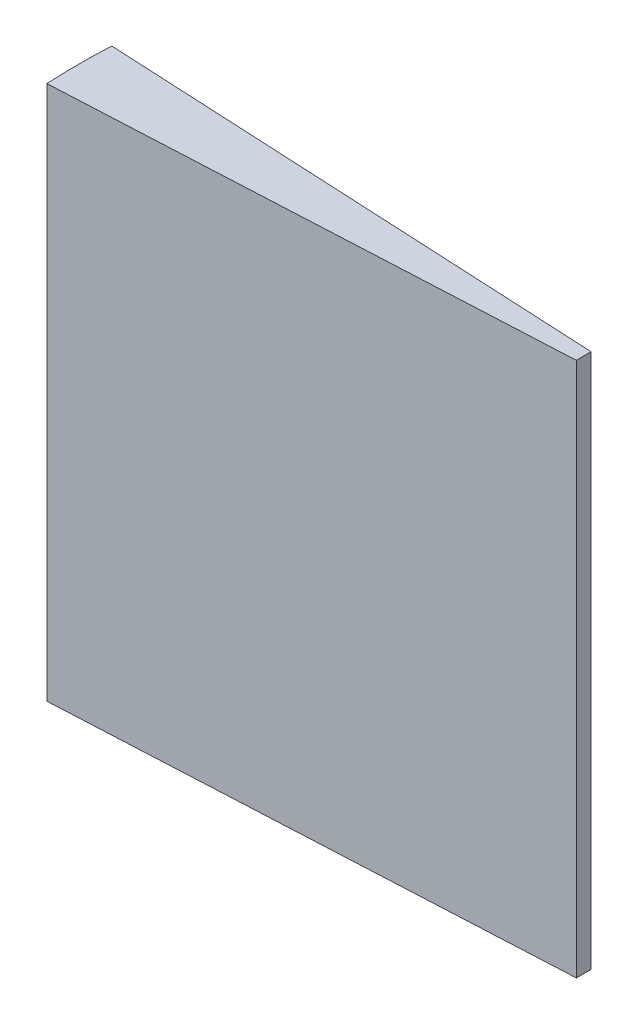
ISO-10303-21;
HEADER;
FILE_DESCRIPTION(('STEP AP214'),'2;1');
FILE_NAME('part.step','',(''),(''),'','','');
FILE_SCHEMA(('AUTOMOTIVE_DESIGN { 1 0 10303 214 1 1 1 1 }'));
ENDSEC;
DATA;
#1=APPLICATION_CONTEXT('core data for automotive mechanical design processes');
#2=APPLICATION_PROTOCOL_DEFINITION('international standard','automotive_design',2000,#1);
#3=PRODUCT_CONTEXT('',#1,'mechanical');
#4=PRODUCT('Part','Part','',(#3));
#5=PRODUCT_RELATED_PRODUCT_CATEGORY('part','',(#4));
#6=PRODUCT_DEFINITION_FORMATION('','',#4);
#7=PRODUCT_DEFINITION_CONTEXT('part definition',#1,'design');
#8=PRODUCT_DEFINITION('design','',#6,#7);
#9=PRODUCT_DEFINITION_SHAPE('','',#8);
#10=(LENGTH_UNIT() NAMED_UNIT(*) SI_UNIT(.MILLI.,.METRE.));
#11=(NAMED_UNIT(*) PLANE_ANGLE_UNIT() SI_UNIT($,.RADIAN.));
#12=(NAMED_UNIT(*) SI_UNIT($,.STERADIAN.) SOLID_ANGLE_UNIT());
#13=UNCERTAINTY_MEASURE_WITH_UNIT(LENGTH_MEASURE(1.E-05),#10,'distance_accuracy_value','');
#14=(GEOMETRIC_REPRESENTATION_CONTEXT(3) GLOBAL_UNCERTAINTY_ASSIGNED_CONTEXT((#13)) GLOBAL_UNIT_ASSIGNED_CONTEXT((#10,
#11,#12)) REPRESENTATION_CONTEXT('',''));
#15=CARTESIAN_POINT('',(0.,0.,0.));
#16=DIRECTION('',(0.,0.,1.));
#17=DIRECTION('',(1.,0.,0.));
#18=AXIS2_PLACEMENT_3D('',#15,#16,#17);
#19=CARTESIAN_POINT('',(0.,0.,0.));
#20=DIRECTION('',(0.,-1.,0.));
#21=DIRECTION('',(0.,0.,-1.));
#22=AXIS2_PLACEMENT_3D('',#19,#20,#21);
#23=CYLINDRICAL_SURFACE('',#22,139.7);
#24=CARTESIAN_POINT('',(0.,0.,0.));
#25=DIRECTION('',(0.,-1.,0.));
#26=DIRECTION('',(0.,0.,-1.));
#27=AXIS2_PLACEMENT_3D('',#24,#25,#26);
#28=CIRCLE('',#27,139.7);
#29=CARTESIAN_POINT('',(-139.527208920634,0.,6.94607592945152));
#30=VERTEX_POINT('',#29);
#31=CARTESIAN_POINT('',(-139.527208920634,0.,-6.94607592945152));
#32=VERTEX_POINT('',#31);
#33=EDGE_CURVE('E11',#30,#32,#28,.T.);
#34=ORIENTED_EDGE('',*,*,#33,.F.);
#35=DIRECTION('',(0.,-1.,0.));
#36=VECTOR('',#35,1.);
#37=CARTESIAN_POINT('',(-139.527208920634,0.,6.94607592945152));
#38=LINE('',#37,#36);
#39=CARTESIAN_POINT('',(-139.527208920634,114.3,6.94607592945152));
#40=VERTEX_POINT('',#39);
#41=EDGE_CURVE('E96',#40,#30,#38,.T.);
#42=ORIENTED_EDGE('',*,*,#41,.F.);
#43=CARTESIAN_POINT('',(0.,114.3,0.));
#44=DIRECTION('',(0.,-1.,0.));
#45=DIRECTION('',(0.,0.,-1.));
#46=AXIS2_PLACEMENT_3D('',#43,#44,#45);
#47=CIRCLE('',#46,139.7);
#48=CARTESIAN_POINT('',(-139.527208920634,114.3,-6.94607592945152));
#49=VERTEX_POINT('',#48);
#50=EDGE_CURVE('E49',#40,#49,#47,.T.);
#51=ORIENTED_EDGE('',*,*,#50,.T.);
#52=DIRECTION('',(0.,-1.,0.));
#53=VECTOR('',#52,1.);
#54=CARTESIAN_POINT('',(-139.527208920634,0.,-6.94607592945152));
#55=LINE('',#54,#53);
#56=EDGE_CURVE('E85',#49,#32,#55,.T.);
#57=ORIENTED_EDGE('',*,*,#56,.T.);
#58=EDGE_LOOP('',(#34,#42,#51,#57));
#59=FACE_BOUND('',#58,.T.);
#60=ADVANCED_FACE('F34',(#59),#23,.T.);
#61=CARTESIAN_POINT('',(-31.7107293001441,0.,1.57865362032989));
#62=DIRECTION('',(0.,1.,0.));
#63=DIRECTION('',(0.,0.,1.));
#64=AXIS2_PLACEMENT_3D('',#61,#62,#63);
#65=PLANE('',#64);
#66=CARTESIAN_POINT('',(0.,0.,0.));
#67=DIRECTION('',(0.,-1.,0.));
#68=DIRECTION('',(0.,0.,-1.));
#69=AXIS2_PLACEMENT_3D('',#66,#67,#68);
#70=CIRCLE('',#69,31.75);
#71=CARTESIAN_POINT('',(-31.7107293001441,0.,1.57865362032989));
#72=VERTEX_POINT('',#71);
#73=CARTESIAN_POINT('',(-31.7107293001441,0.,-1.57865362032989));
#74=VERTEX_POINT('',#73);
#75=EDGE_CURVE('E42',#72,#74,#70,.T.);
#76=ORIENTED_EDGE('',*,*,#75,.F.);
#77=DIRECTION('',(0.998763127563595,0.,-0.049721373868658));
#78=VECTOR('',#77,1.);
#79=CARTESIAN_POINT('',(-31.7107293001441,0.,1.57865362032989));
#80=LINE('',#79,#78);
#81=EDGE_CURVE('E81',#30,#72,#80,.T.);
#82=ORIENTED_EDGE('',*,*,#81,.F.);
#83=ORIENTED_EDGE('',*,*,#33,.T.);
#84=DIRECTION('',(0.998763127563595,0.,0.049721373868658));
#85=VECTOR('',#84,1.);
#86=CARTESIAN_POINT('',(-31.7107293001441,0.,-1.57865362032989));
#87=LINE('',#86,#85);
#88=EDGE_CURVE('E78',#32,#74,#87,.T.);
#89=ORIENTED_EDGE('',*,*,#88,.T.);
#90=EDGE_LOOP('',(#76,#82,#83,#89));
#91=FACE_BOUND('',#90,.T.);
#92=ADVANCED_FACE('F36',(#91),#65,.F.);
#93=CARTESIAN_POINT('',(0.,0.,0.));
#94=DIRECTION('',(0.,-1.,0.));
#95=DIRECTION('',(0.,0.,-1.));
#96=AXIS2_PLACEMENT_3D('',#93,#94,#95);
#97=CYLINDRICAL_SURFACE('',#96,31.75);
#98=CARTESIAN_POINT('',(0.,114.3,0.));
#99=DIRECTION('',(0.,-1.,0.));
#100=DIRECTION('',(0.,0.,-1.));
#101=AXIS2_PLACEMENT_3D('',#98,#99,#100);
#102=CIRCLE('',#101,31.75);
#103=CARTESIAN_POINT('',(-31.7107293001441,114.3,1.57865362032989));
#104=VERTEX_POINT('',#103);
#105=CARTESIAN_POINT('',(-31.7107293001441,114.3,-1.57865362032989));
#106=VERTEX_POINT('',#105);
#107=EDGE_CURVE('E57',#104,#106,#102,.T.);
#108=ORIENTED_EDGE('',*,*,#107,.F.);
#109=DIRECTION('',(0.,1.,0.));
#110=VECTOR('',#109,1.);
#111=CARTESIAN_POINT('',(-31.7107293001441,0.,1.57865362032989));
#112=LINE('',#111,#110);
#113=EDGE_CURVE('E99',#72,#104,#112,.T.);
#114=ORIENTED_EDGE('',*,*,#113,.F.);
#115=ORIENTED_EDGE('',*,*,#75,.T.);
#116=DIRECTION('',(0.,1.,0.));
#117=VECTOR('',#116,1.);
#118=CARTESIAN_POINT('',(-31.7107293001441,0.,-1.57865362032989));
#119=LINE('',#118,#117);
#120=EDGE_CURVE('E90',#74,#106,#119,.T.);
#121=ORIENTED_EDGE('',*,*,#120,.T.);
#122=EDGE_LOOP('',(#108,#114,#115,#121));
#123=FACE_BOUND('',#122,.T.);
#124=ADVANCED_FACE('F105',(#123),#97,.F.);
#125=CARTESIAN_POINT('',(-31.7107293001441,114.3,1.57865362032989));
#126=DIRECTION('',(0.,-1.,0.));
#127=DIRECTION('',(0.,0.,-1.));
#128=AXIS2_PLACEMENT_3D('',#125,#126,#127);
#129=PLANE('',#128);
#130=DIRECTION('',(-0.998763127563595,0.,0.049721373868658));
#131=VECTOR('',#130,1.);
#132=CARTESIAN_POINT('',(-31.7107293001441,114.3,1.57865362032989));
#133=LINE('',#132,#131);
#134=EDGE_CURVE('E101',#104,#40,#133,.T.);
#135=ORIENTED_EDGE('',*,*,#134,.F.);
#136=ORIENTED_EDGE('',*,*,#107,.T.);
#137=DIRECTION('',(-0.998763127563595,0.,-0.049721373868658));
#138=VECTOR('',#137,1.);
#139=CARTESIAN_POINT('',(-31.7107293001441,114.3,-1.57865362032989));
#140=LINE('',#139,#138);
#141=EDGE_CURVE('E92',#106,#49,#140,.T.);
#142=ORIENTED_EDGE('',*,*,#141,.T.);
#143=ORIENTED_EDGE('',*,*,#50,.F.);
#144=EDGE_LOOP('',(#135,#136,#142,#143));
#145=FACE_BOUND('',#144,.T.);
#146=ADVANCED_FACE('F108',(#145),#129,.F.);
#147=CARTESIAN_POINT('',(-139.527208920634,114.3,6.94607592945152));
#148=DIRECTION('',(0.049721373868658,0.,0.998763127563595));
#149=DIRECTION('',(0.998763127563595,0.,-0.049721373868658));
#150=AXIS2_PLACEMENT_3D('',#147,#148,#149);
#151=PLANE('',#150);
#152=ORIENTED_EDGE('',*,*,#41,.T.);
#153=ORIENTED_EDGE('',*,*,#81,.T.);
#154=ORIENTED_EDGE('',*,*,#113,.T.);
#155=ORIENTED_EDGE('',*,*,#134,.T.);
#156=EDGE_LOOP('',(#152,#153,#154,#155));
#157=FACE_BOUND('',#156,.T.);
#158=ADVANCED_FACE('F107',(#157),#151,.T.);
#159=CARTESIAN_POINT('',(-139.527208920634,114.3,-6.94607592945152));
#160=DIRECTION('',(-0.049721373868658,0.,0.998763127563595));
#161=DIRECTION('',(0.998763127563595,0.,0.049721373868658));
#162=AXIS2_PLACEMENT_3D('',#159,#160,#161);
#163=PLANE('',#162);
#164=ORIENTED_EDGE('',*,*,#56,.F.);
#165=ORIENTED_EDGE('',*,*,#141,.F.);
#166=ORIENTED_EDGE('',*,*,#120,.F.);
#167=ORIENTED_EDGE('',*,*,#88,.F.);
#168=EDGE_LOOP('',(#164,#165,#166,#167));
#169=FACE_BOUND('',#168,.T.);
#170=ADVANCED_FACE('F89',(#169),#163,.F.);
#171=CLOSED_SHELL('',(#60,#92,#124,#146,#158,#170));
#172=MANIFOLD_SOLID_BREP('B2',#171);
#173=ADVANCED_BREP_SHAPE_REPRESENTATION('',(#18,#172),#14);
#174=SHAPE_DEFINITION_REPRESENTATION(#9,#173);
ENDSEC;
END-ISO-10303-21;
